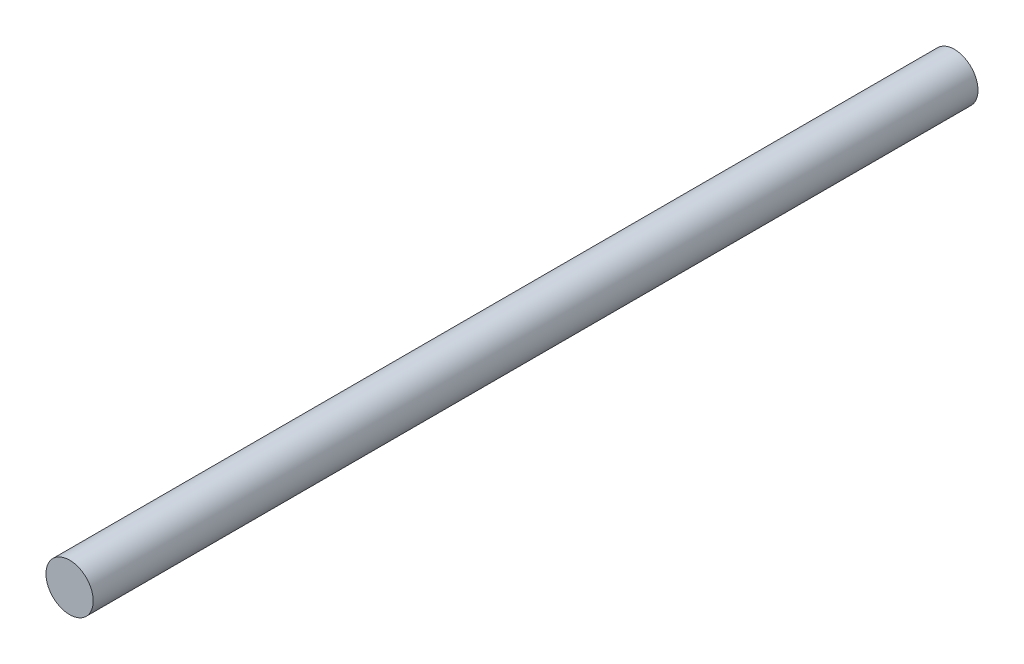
ISO-10303-21;
HEADER;
FILE_DESCRIPTION(('STEP AP214'),'2;1');
FILE_NAME('part.step','',(''),(''),'','','');
FILE_SCHEMA(('AUTOMOTIVE_DESIGN { 1 0 10303 214 1 1 1 1 }'));
ENDSEC;
DATA;
#1=APPLICATION_CONTEXT('core data for automotive mechanical design processes');
#2=APPLICATION_PROTOCOL_DEFINITION('international standard','automotive_design',2000,#1);
#3=PRODUCT_CONTEXT('',#1,'mechanical');
#4=PRODUCT('Part','Part','',(#3));
#5=PRODUCT_RELATED_PRODUCT_CATEGORY('part','',(#4));
#6=PRODUCT_DEFINITION_FORMATION('','',#4);
#7=PRODUCT_DEFINITION_CONTEXT('part definition',#1,'design');
#8=PRODUCT_DEFINITION('design','',#6,#7);
#9=PRODUCT_DEFINITION_SHAPE('','',#8);
#10=(LENGTH_UNIT() NAMED_UNIT(*) SI_UNIT(.MILLI.,.METRE.));
#11=(NAMED_UNIT(*) PLANE_ANGLE_UNIT() SI_UNIT($,.RADIAN.));
#12=(NAMED_UNIT(*) SI_UNIT($,.STERADIAN.) SOLID_ANGLE_UNIT());
#13=UNCERTAINTY_MEASURE_WITH_UNIT(LENGTH_MEASURE(1.E-05),#10,'distance_accuracy_value','');
#14=(GEOMETRIC_REPRESENTATION_CONTEXT(3) GLOBAL_UNCERTAINTY_ASSIGNED_CONTEXT((#13)) GLOBAL_UNIT_ASSIGNED_CONTEXT((#10,
#11,#12)) REPRESENTATION_CONTEXT('',''));
#15=CARTESIAN_POINT('',(0.,0.,0.));
#16=DIRECTION('',(0.,0.,1.));
#17=DIRECTION('',(1.,0.,0.));
#18=AXIS2_PLACEMENT_3D('',#15,#16,#17);
#19=CARTESIAN_POINT('',(0.,0.,88.9));
#20=DIRECTION('',(0.,0.,-1.));
#21=DIRECTION('',(-1.,0.,0.));
#22=AXIS2_PLACEMENT_3D('',#19,#20,#21);
#23=CYLINDRICAL_SURFACE('',#22,2.3749);
#24=CARTESIAN_POINT('',(0.,0.,88.9));
#25=DIRECTION('',(0.,0.,1.));
#26=DIRECTION('',(1.,0.,0.));
#27=AXIS2_PLACEMENT_3D('',#24,#25,#26);
#28=CIRCLE('',#27,2.3749);
#29=CARTESIAN_POINT('',(2.3749,0.,88.9));
#30=VERTEX_POINT('',#29);
#31=EDGE_CURVE('E10',#30,#30,#28,.T.);
#32=ORIENTED_EDGE('',*,*,#31,.F.);
#33=EDGE_LOOP('',(#32));
#34=FACE_BOUND('',#33,.T.);
#35=CARTESIAN_POINT('',(0.,0.,0.));
#36=DIRECTION('',(0.,0.,1.));
#37=DIRECTION('',(1.,0.,0.));
#38=AXIS2_PLACEMENT_3D('',#35,#36,#37);
#39=CIRCLE('',#38,2.3749);
#40=CARTESIAN_POINT('',(2.3749,0.,0.));
#41=VERTEX_POINT('',#40);
#42=EDGE_CURVE('E43',#41,#41,#39,.T.);
#43=ORIENTED_EDGE('',*,*,#42,.T.);
#44=EDGE_LOOP('',(#43));
#45=FACE_BOUND('',#44,.T.);
#46=ADVANCED_FACE('F37',(#34,#45),#23,.T.);
#47=CARTESIAN_POINT('',(0.,0.,88.9));
#48=DIRECTION('',(0.,0.,1.));
#49=DIRECTION('',(1.,0.,0.));
#50=AXIS2_PLACEMENT_3D('',#47,#48,#49);
#51=PLANE('',#50);
#52=ORIENTED_EDGE('',*,*,#31,.T.);
#53=EDGE_LOOP('',(#52));
#54=FACE_BOUND('',#53,.T.);
#55=ADVANCED_FACE('F52',(#54),#51,.T.);
#56=CARTESIAN_POINT('',(0.,0.,0.));
#57=DIRECTION('',(0.,0.,1.));
#58=DIRECTION('',(1.,0.,0.));
#59=AXIS2_PLACEMENT_3D('',#56,#57,#58);
#60=PLANE('',#59);
#61=ORIENTED_EDGE('',*,*,#42,.F.);
#62=EDGE_LOOP('',(#61));
#63=FACE_BOUND('',#62,.T.);
#64=ADVANCED_FACE('F50',(#63),#60,.F.);
#65=CLOSED_SHELL('',(#46,#55,#64));
#66=MANIFOLD_SOLID_BREP('B2',#65);
#67=ADVANCED_BREP_SHAPE_REPRESENTATION('',(#18,#66),#14);
#68=SHAPE_DEFINITION_REPRESENTATION(#9,#67);
ENDSEC;
END-ISO-10303-21;
